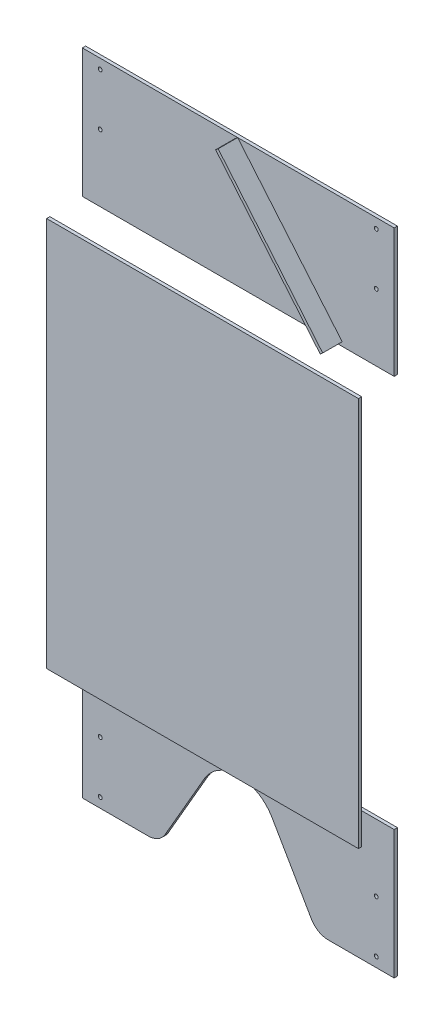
ISO-10303-21;
HEADER;
FILE_DESCRIPTION(('STEP AP214'),'2;1');
FILE_NAME('part.step','',(''),(''),'','','');
FILE_SCHEMA(('AUTOMOTIVE_DESIGN { 1 0 10303 214 1 1 1 1 }'));
ENDSEC;
DATA;
#1=APPLICATION_CONTEXT('core data for automotive mechanical design processes');
#2=APPLICATION_PROTOCOL_DEFINITION('international standard','automotive_design',2000,#1);
#3=PRODUCT_CONTEXT('',#1,'mechanical');
#4=PRODUCT('Part','Part','',(#3));
#5=PRODUCT_RELATED_PRODUCT_CATEGORY('part','',(#4));
#6=PRODUCT_DEFINITION_FORMATION('','',#4);
#7=PRODUCT_DEFINITION_CONTEXT('part definition',#1,'design');
#8=PRODUCT_DEFINITION('design','',#6,#7);
#9=PRODUCT_DEFINITION_SHAPE('','',#8);
#10=(LENGTH_UNIT() NAMED_UNIT(*) SI_UNIT(.MILLI.,.METRE.));
#11=(NAMED_UNIT(*) PLANE_ANGLE_UNIT() SI_UNIT($,.RADIAN.));
#12=(NAMED_UNIT(*) SI_UNIT($,.STERADIAN.) SOLID_ANGLE_UNIT());
#13=UNCERTAINTY_MEASURE_WITH_UNIT(LENGTH_MEASURE(1.E-05),#10,'distance_accuracy_value','');
#14=(GEOMETRIC_REPRESENTATION_CONTEXT(3) GLOBAL_UNCERTAINTY_ASSIGNED_CONTEXT((#13)) GLOBAL_UNIT_ASSIGNED_CONTEXT((#10,
#11,#12)) REPRESENTATION_CONTEXT('',''));
#15=CARTESIAN_POINT('',(0.,0.,0.));
#16=DIRECTION('',(0.,0.,1.));
#17=DIRECTION('',(1.,0.,0.));
#18=AXIS2_PLACEMENT_3D('',#15,#16,#17);
#19=CARTESIAN_POINT('',(212.5,-905.,-60.));
#20=DIRECTION('',(0.,0.,1.));
#21=DIRECTION('',(1.,0.,0.));
#22=AXIS2_PLACEMENT_3D('',#19,#20,#21);
#23=CYLINDRICAL_SURFACE('',#22,3.);
#24=CARTESIAN_POINT('',(212.5,-905.,-60.));
#25=DIRECTION('',(0.,0.,1.));
#26=DIRECTION('',(1.,0.,0.));
#27=AXIS2_PLACEMENT_3D('',#24,#25,#26);
#28=CIRCLE('',#27,3.);
#29=CARTESIAN_POINT('',(215.5,-905.,-60.));
#30=VERTEX_POINT('',#29);
#31=EDGE_CURVE('E184',#30,#30,#28,.T.);
#32=ORIENTED_EDGE('',*,*,#31,.F.);
#33=EDGE_LOOP('',(#32));
#34=FACE_BOUND('',#33,.T.);
#35=CARTESIAN_POINT('',(212.5,-905.,-55.));
#36=DIRECTION('',(0.,0.,1.));
#37=DIRECTION('',(1.,0.,0.));
#38=AXIS2_PLACEMENT_3D('',#35,#36,#37);
#39=CIRCLE('',#38,3.);
#40=CARTESIAN_POINT('',(215.5,-905.,-55.));
#41=VERTEX_POINT('',#40);
#42=EDGE_CURVE('E180',#41,#41,#39,.T.);
#43=ORIENTED_EDGE('',*,*,#42,.T.);
#44=EDGE_LOOP('',(#43));
#45=FACE_BOUND('',#44,.T.);
#46=ADVANCED_FACE('F45',(#34,#45),#23,.F.);
#47=CARTESIAN_POINT('',(212.5,-985.,-60.));
#48=DIRECTION('',(0.,0.,1.));
#49=DIRECTION('',(1.,0.,0.));
#50=AXIS2_PLACEMENT_3D('',#47,#48,#49);
#51=CYLINDRICAL_SURFACE('',#50,3.);
#52=CARTESIAN_POINT('',(212.5,-985.,-60.));
#53=DIRECTION('',(0.,0.,1.));
#54=DIRECTION('',(1.,0.,0.));
#55=AXIS2_PLACEMENT_3D('',#52,#53,#54);
#56=CIRCLE('',#55,3.);
#57=CARTESIAN_POINT('',(215.5,-985.,-60.));
#58=VERTEX_POINT('',#57);
#59=EDGE_CURVE('E187',#58,#58,#56,.T.);
#60=ORIENTED_EDGE('',*,*,#59,.F.);
#61=EDGE_LOOP('',(#60));
#62=FACE_BOUND('',#61,.T.);
#63=CARTESIAN_POINT('',(212.5,-985.,-55.));
#64=DIRECTION('',(0.,0.,1.));
#65=DIRECTION('',(1.,0.,0.));
#66=AXIS2_PLACEMENT_3D('',#63,#64,#65);
#67=CIRCLE('',#66,3.);
#68=CARTESIAN_POINT('',(215.5,-985.,-55.));
#69=VERTEX_POINT('',#68);
#70=EDGE_CURVE('E183',#69,#69,#67,.T.);
#71=ORIENTED_EDGE('',*,*,#70,.T.);
#72=EDGE_LOOP('',(#71));
#73=FACE_BOUND('',#72,.T.);
#74=ADVANCED_FACE('F242',(#62,#73),#51,.F.);
#75=CARTESIAN_POINT('',(-212.5,-905.,-60.));
#76=DIRECTION('',(0.,0.,1.));
#77=DIRECTION('',(1.,0.,0.));
#78=AXIS2_PLACEMENT_3D('',#75,#76,#77);
#79=CYLINDRICAL_SURFACE('',#78,3.);
#80=CARTESIAN_POINT('',(-212.5,-905.,-60.));
#81=DIRECTION('',(0.,0.,1.));
#82=DIRECTION('',(1.,0.,0.));
#83=AXIS2_PLACEMENT_3D('',#80,#81,#82);
#84=CIRCLE('',#83,3.);
#85=CARTESIAN_POINT('',(-209.5,-905.,-60.));
#86=VERTEX_POINT('',#85);
#87=EDGE_CURVE('E193',#86,#86,#84,.T.);
#88=ORIENTED_EDGE('',*,*,#87,.F.);
#89=EDGE_LOOP('',(#88));
#90=FACE_BOUND('',#89,.T.);
#91=CARTESIAN_POINT('',(-212.5,-905.,-55.));
#92=DIRECTION('',(0.,0.,1.));
#93=DIRECTION('',(1.,0.,0.));
#94=AXIS2_PLACEMENT_3D('',#91,#92,#93);
#95=CIRCLE('',#94,3.);
#96=CARTESIAN_POINT('',(-209.5,-905.,-55.));
#97=VERTEX_POINT('',#96);
#98=EDGE_CURVE('E190',#97,#97,#95,.T.);
#99=ORIENTED_EDGE('',*,*,#98,.T.);
#100=EDGE_LOOP('',(#99));
#101=FACE_BOUND('',#100,.T.);
#102=ADVANCED_FACE('F248',(#90,#101),#79,.F.);
#103=CARTESIAN_POINT('',(-212.5,-985.,-60.));
#104=DIRECTION('',(0.,0.,1.));
#105=DIRECTION('',(1.,0.,0.));
#106=AXIS2_PLACEMENT_3D('',#103,#104,#105);
#107=CYLINDRICAL_SURFACE('',#106,3.);
#108=CARTESIAN_POINT('',(-212.5,-985.,-60.));
#109=DIRECTION('',(0.,0.,1.));
#110=DIRECTION('',(1.,0.,0.));
#111=AXIS2_PLACEMENT_3D('',#108,#109,#110);
#112=CIRCLE('',#111,3.);
#113=CARTESIAN_POINT('',(-209.5,-985.,-60.));
#114=VERTEX_POINT('',#113);
#115=EDGE_CURVE('E198',#114,#114,#112,.T.);
#116=ORIENTED_EDGE('',*,*,#115,.F.);
#117=EDGE_LOOP('',(#116));
#118=FACE_BOUND('',#117,.T.);
#119=CARTESIAN_POINT('',(-212.5,-985.,-55.));
#120=DIRECTION('',(0.,0.,1.));
#121=DIRECTION('',(1.,0.,0.));
#122=AXIS2_PLACEMENT_3D('',#119,#120,#121);
#123=CIRCLE('',#122,3.);
#124=CARTESIAN_POINT('',(-209.5,-985.,-55.));
#125=VERTEX_POINT('',#124);
#126=EDGE_CURVE('E160',#125,#125,#123,.T.);
#127=ORIENTED_EDGE('',*,*,#126,.T.);
#128=EDGE_LOOP('',(#127));
#129=FACE_BOUND('',#128,.T.);
#130=ADVANCED_FACE('F259',(#118,#129),#107,.F.);
#131=CARTESIAN_POINT('',(138.564064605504,-1000.,-60.));
#132=DIRECTION('',(0.,-1.,0.));
#133=DIRECTION('',(0.,0.,-1.));
#134=AXIS2_PLACEMENT_3D('',#131,#132,#133);
#135=PLANE('',#134);
#136=DIRECTION('',(1.,0.,0.));
#137=VECTOR('',#136,1.);
#138=CARTESIAN_POINT('',(138.564064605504,-1000.,-55.));
#139=LINE('',#138,#137);
#140=CARTESIAN_POINT('',(138.564064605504,-1000.,-55.));
#141=VERTEX_POINT('',#140);
#142=CARTESIAN_POINT('',(240.,-1000.,-55.));
#143=VERTEX_POINT('',#142);
#144=EDGE_CURVE('E208',#141,#143,#139,.T.);
#145=ORIENTED_EDGE('',*,*,#144,.F.);
#146=DIRECTION('',(0.,0.,1.));
#147=VECTOR('',#146,1.);
#148=CARTESIAN_POINT('',(138.564064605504,-1000.,-60.));
#149=LINE('',#148,#147);
#150=CARTESIAN_POINT('',(138.564064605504,-1000.,-60.));
#151=VERTEX_POINT('',#150);
#152=EDGE_CURVE('E164',#151,#141,#149,.T.);
#153=ORIENTED_EDGE('',*,*,#152,.F.);
#154=DIRECTION('',(1.,0.,0.));
#155=VECTOR('',#154,1.);
#156=CARTESIAN_POINT('',(138.564064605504,-1000.,-60.));
#157=LINE('',#156,#155);
#158=CARTESIAN_POINT('',(240.,-1000.,-60.));
#159=VERTEX_POINT('',#158);
#160=EDGE_CURVE('E157',#151,#159,#157,.T.);
#161=ORIENTED_EDGE('',*,*,#160,.T.);
#162=DIRECTION('',(0.,0.,1.));
#163=VECTOR('',#162,1.);
#164=CARTESIAN_POINT('',(240.,-1000.,-60.));
#165=LINE('',#164,#163);
#166=EDGE_CURVE('E81',#159,#143,#165,.T.);
#167=ORIENTED_EDGE('',*,*,#166,.T.);
#168=EDGE_LOOP('',(#145,#153,#161,#167));
#169=FACE_BOUND('',#168,.T.);
#170=ADVANCED_FACE('F254',(#169),#135,.T.);
#171=CARTESIAN_POINT('',(138.564064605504,-970.,-60.));
#172=DIRECTION('',(0.,0.,1.));
#173=DIRECTION('',(1.,0.,0.));
#174=AXIS2_PLACEMENT_3D('',#171,#172,#173);
#175=CYLINDRICAL_SURFACE('',#174,30.);
#176=CARTESIAN_POINT('',(138.564064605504,-970.,-55.));
#177=DIRECTION('',(0.,0.,1.));
#178=DIRECTION('',(1.,0.,0.));
#179=AXIS2_PLACEMENT_3D('',#176,#177,#178);
#180=CIRCLE('',#179,30.);
#181=CARTESIAN_POINT('',(112.58330249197,-984.999999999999,-55.));
#182=VERTEX_POINT('',#181);
#183=EDGE_CURVE('E210',#182,#141,#180,.T.);
#184=ORIENTED_EDGE('',*,*,#183,.F.);
#185=DIRECTION('',(0.,0.,1.));
#186=VECTOR('',#185,1.);
#187=CARTESIAN_POINT('',(112.58330249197,-984.999999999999,-60.));
#188=LINE('',#187,#186);
#189=CARTESIAN_POINT('',(112.58330249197,-984.999999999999,-60.));
#190=VERTEX_POINT('',#189);
#191=EDGE_CURVE('E168',#190,#182,#188,.T.);
#192=ORIENTED_EDGE('',*,*,#191,.F.);
#193=CARTESIAN_POINT('',(138.564064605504,-970.,-60.));
#194=DIRECTION('',(0.,0.,1.));
#195=DIRECTION('',(1.,0.,0.));
#196=AXIS2_PLACEMENT_3D('',#193,#194,#195);
#197=CIRCLE('',#196,30.);
#198=EDGE_CURVE('E161',#190,#151,#197,.T.);
#199=ORIENTED_EDGE('',*,*,#198,.T.);
#200=ORIENTED_EDGE('',*,*,#152,.T.);
#201=EDGE_LOOP('',(#184,#192,#199,#200));
#202=FACE_BOUND('',#201,.T.);
#203=ADVANCED_FACE('F283',(#202),#175,.T.);
#204=CARTESIAN_POINT('',(112.58330249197,-984.999999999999,-60.));
#205=DIRECTION('',(-0.866025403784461,-0.499999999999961,0.));
#206=DIRECTION('',(0.499999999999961,-0.866025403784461,0.));
#207=AXIS2_PLACEMENT_3D('',#204,#205,#206);
#208=PLANE('',#207);
#209=DIRECTION('',(0.499999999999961,-0.866025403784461,0.));
#210=VECTOR('',#209,1.);
#211=CARTESIAN_POINT('',(112.58330249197,-984.999999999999,-55.));
#212=LINE('',#211,#210);
#213=CARTESIAN_POINT('',(51.9615242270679,-880.000000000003,-55.));
#214=VERTEX_POINT('',#213);
#215=EDGE_CURVE('E214',#214,#182,#212,.T.);
#216=ORIENTED_EDGE('',*,*,#215,.F.);
#217=DIRECTION('',(0.,0.,1.));
#218=VECTOR('',#217,1.);
#219=CARTESIAN_POINT('',(51.9615242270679,-880.000000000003,-60.));
#220=LINE('',#219,#218);
#221=CARTESIAN_POINT('',(51.9615242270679,-880.000000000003,-60.));
#222=VERTEX_POINT('',#221);
#223=EDGE_CURVE('E172',#222,#214,#220,.T.);
#224=ORIENTED_EDGE('',*,*,#223,.F.);
#225=DIRECTION('',(0.499999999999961,-0.866025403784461,0.));
#226=VECTOR('',#225,1.);
#227=CARTESIAN_POINT('',(112.58330249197,-984.999999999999,-60.));
#228=LINE('',#227,#226);
#229=EDGE_CURVE('E165',#222,#190,#228,.T.);
#230=ORIENTED_EDGE('',*,*,#229,.T.);
#231=ORIENTED_EDGE('',*,*,#191,.T.);
#232=EDGE_LOOP('',(#216,#224,#230,#231));
#233=FACE_BOUND('',#232,.T.);
#234=ADVANCED_FACE('F287',(#233),#208,.T.);
#235=CARTESIAN_POINT('',(0.,-910.,-60.));
#236=DIRECTION('',(0.,0.,1.));
#237=DIRECTION('',(1.,0.,0.));
#238=AXIS2_PLACEMENT_3D('',#235,#236,#237);
#239=CYLINDRICAL_SURFACE('',#238,60.);
#240=CARTESIAN_POINT('',(0.,-910.,-55.));
#241=DIRECTION('',(0.,0.,-1.));
#242=DIRECTION('',(1.,0.,0.));
#243=AXIS2_PLACEMENT_3D('',#240,#241,#242);
#244=CIRCLE('',#243,60.);
#245=CARTESIAN_POINT('',(-51.9615242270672,-880.000000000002,-55.));
#246=VERTEX_POINT('',#245);
#247=EDGE_CURVE('E221',#246,#214,#244,.T.);
#248=ORIENTED_EDGE('',*,*,#247,.F.);
#249=DIRECTION('',(0.,0.,1.));
#250=VECTOR('',#249,1.);
#251=CARTESIAN_POINT('',(-51.9615242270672,-880.000000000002,-60.));
#252=LINE('',#251,#250);
#253=CARTESIAN_POINT('',(-51.9615242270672,-880.000000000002,-60.));
#254=VERTEX_POINT('',#253);
#255=EDGE_CURVE('E124',#254,#246,#252,.T.);
#256=ORIENTED_EDGE('',*,*,#255,.F.);
#257=CARTESIAN_POINT('',(0.,-910.,-60.));
#258=DIRECTION('',(0.,0.,-1.));
#259=DIRECTION('',(1.,0.,0.));
#260=AXIS2_PLACEMENT_3D('',#257,#258,#259);
#261=CIRCLE('',#260,60.);
#262=EDGE_CURVE('E169',#254,#222,#261,.T.);
#263=ORIENTED_EDGE('',*,*,#262,.T.);
#264=ORIENTED_EDGE('',*,*,#223,.T.);
#265=EDGE_LOOP('',(#248,#256,#263,#264));
#266=FACE_BOUND('',#265,.T.);
#267=ADVANCED_FACE('F239',(#266),#239,.F.);
#268=CARTESIAN_POINT('',(-112.58330249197,-984.999999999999,-60.));
#269=DIRECTION('',(0.866025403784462,-0.49999999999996,0.));
#270=DIRECTION('',(0.49999999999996,0.866025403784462,0.));
#271=AXIS2_PLACEMENT_3D('',#268,#269,#270);
#272=PLANE('',#271);
#273=DIRECTION('',(0.49999999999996,0.866025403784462,0.));
#274=VECTOR('',#273,1.);
#275=CARTESIAN_POINT('',(-112.58330249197,-984.999999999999,-55.));
#276=LINE('',#275,#274);
#277=CARTESIAN_POINT('',(-112.58330249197,-984.999999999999,-55.));
#278=VERTEX_POINT('',#277);
#279=EDGE_CURVE('E153',#278,#246,#276,.T.);
#280=ORIENTED_EDGE('',*,*,#279,.F.);
#281=DIRECTION('',(0.,0.,1.));
#282=VECTOR('',#281,1.);
#283=CARTESIAN_POINT('',(-112.58330249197,-984.999999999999,-60.));
#284=LINE('',#283,#282);
#285=CARTESIAN_POINT('',(-112.58330249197,-984.999999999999,-60.));
#286=VERTEX_POINT('',#285);
#287=EDGE_CURVE('E177',#286,#278,#284,.T.);
#288=ORIENTED_EDGE('',*,*,#287,.F.);
#289=DIRECTION('',(0.49999999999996,0.866025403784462,0.));
#290=VECTOR('',#289,1.);
#291=CARTESIAN_POINT('',(-112.58330249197,-984.999999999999,-60.));
#292=LINE('',#291,#290);
#293=EDGE_CURVE('E173',#286,#254,#292,.T.);
#294=ORIENTED_EDGE('',*,*,#293,.T.);
#295=ORIENTED_EDGE('',*,*,#255,.T.);
#296=EDGE_LOOP('',(#280,#288,#294,#295));
#297=FACE_BOUND('',#296,.T.);
#298=ADVANCED_FACE('F224',(#297),#272,.T.);
#299=CARTESIAN_POINT('',(-138.564064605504,-970.,-60.));
#300=DIRECTION('',(0.,0.,1.));
#301=DIRECTION('',(1.,0.,0.));
#302=AXIS2_PLACEMENT_3D('',#299,#300,#301);
#303=CYLINDRICAL_SURFACE('',#302,29.9999999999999);
#304=CARTESIAN_POINT('',(-138.564064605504,-970.,-55.));
#305=DIRECTION('',(0.,0.,1.));
#306=DIRECTION('',(1.,0.,0.));
#307=AXIS2_PLACEMENT_3D('',#304,#305,#306);
#308=CIRCLE('',#307,29.9999999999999);
#309=CARTESIAN_POINT('',(-138.564064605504,-1000.,-55.));
#310=VERTEX_POINT('',#309);
#311=EDGE_CURVE('E151',#310,#278,#308,.T.);
#312=ORIENTED_EDGE('',*,*,#311,.F.);
#313=DIRECTION('',(0.,0.,1.));
#314=VECTOR('',#313,1.);
#315=CARTESIAN_POINT('',(-138.564064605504,-1000.,-60.));
#316=LINE('',#315,#314);
#317=CARTESIAN_POINT('',(-138.564064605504,-1000.,-60.));
#318=VERTEX_POINT('',#317);
#319=EDGE_CURVE('E114',#318,#310,#316,.T.);
#320=ORIENTED_EDGE('',*,*,#319,.F.);
#321=CARTESIAN_POINT('',(-138.564064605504,-970.,-60.));
#322=DIRECTION('',(0.,0.,1.));
#323=DIRECTION('',(1.,0.,0.));
#324=AXIS2_PLACEMENT_3D('',#321,#322,#323);
#325=CIRCLE('',#324,29.9999999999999);
#326=EDGE_CURVE('E175',#318,#286,#325,.T.);
#327=ORIENTED_EDGE('',*,*,#326,.T.);
#328=ORIENTED_EDGE('',*,*,#287,.T.);
#329=EDGE_LOOP('',(#312,#320,#327,#328));
#330=FACE_BOUND('',#329,.T.);
#331=ADVANCED_FACE('F231',(#330),#303,.T.);
#332=CARTESIAN_POINT('',(-240.,-1000.,-60.));
#333=DIRECTION('',(0.,-1.,0.));
#334=DIRECTION('',(0.,0.,-1.));
#335=AXIS2_PLACEMENT_3D('',#332,#333,#334);
#336=PLANE('',#335);
#337=DIRECTION('',(1.,0.,0.));
#338=VECTOR('',#337,1.);
#339=CARTESIAN_POINT('',(-240.,-1000.,-55.));
#340=LINE('',#339,#338);
#341=CARTESIAN_POINT('',(-240.,-1000.,-55.));
#342=VERTEX_POINT('',#341);
#343=EDGE_CURVE('E139',#342,#310,#340,.T.);
#344=ORIENTED_EDGE('',*,*,#343,.F.);
#345=DIRECTION('',(0.,0.,1.));
#346=VECTOR('',#345,1.);
#347=CARTESIAN_POINT('',(-240.,-1000.,-60.));
#348=LINE('',#347,#346);
#349=CARTESIAN_POINT('',(-240.,-1000.,-60.));
#350=VERTEX_POINT('',#349);
#351=EDGE_CURVE('E143',#350,#342,#348,.T.);
#352=ORIENTED_EDGE('',*,*,#351,.F.);
#353=DIRECTION('',(1.,0.,0.));
#354=VECTOR('',#353,1.);
#355=CARTESIAN_POINT('',(-240.,-1000.,-60.));
#356=LINE('',#355,#354);
#357=EDGE_CURVE('E178',#350,#318,#356,.T.);
#358=ORIENTED_EDGE('',*,*,#357,.T.);
#359=ORIENTED_EDGE('',*,*,#319,.T.);
#360=EDGE_LOOP('',(#344,#352,#358,#359));
#361=FACE_BOUND('',#360,.T.);
#362=ADVANCED_FACE('F150',(#361),#336,.T.);
#363=CARTESIAN_POINT('',(138.564064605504,-970.,-55.));
#364=DIRECTION('',(0.,0.,1.));
#365=DIRECTION('',(1.,0.,0.));
#366=AXIS2_PLACEMENT_3D('',#363,#364,#365);
#367=PLANE('',#366);
#368=DIRECTION('',(1.,0.,0.));
#369=VECTOR('',#368,1.);
#370=CARTESIAN_POINT('',(138.564064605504,-802.,-55.));
#371=LINE('',#370,#369);
#372=CARTESIAN_POINT('',(-240.,-802.,-55.));
#373=VERTEX_POINT('',#372);
#374=CARTESIAN_POINT('',(240.,-802.,-55.));
#375=VERTEX_POINT('',#374);
#376=EDGE_CURVE('E12',#373,#375,#371,.T.);
#377=ORIENTED_EDGE('',*,*,#376,.F.);
#378=DIRECTION('',(0.,-1.,0.));
#379=VECTOR('',#378,1.);
#380=CARTESIAN_POINT('',(-240.,0.,-55.));
#381=LINE('',#380,#379);
#382=EDGE_CURVE('E49',#373,#342,#381,.T.);
#383=ORIENTED_EDGE('',*,*,#382,.T.);
#384=ORIENTED_EDGE('',*,*,#343,.T.);
#385=ORIENTED_EDGE('',*,*,#311,.T.);
#386=ORIENTED_EDGE('',*,*,#279,.T.);
#387=ORIENTED_EDGE('',*,*,#247,.T.);
#388=ORIENTED_EDGE('',*,*,#215,.T.);
#389=ORIENTED_EDGE('',*,*,#183,.T.);
#390=ORIENTED_EDGE('',*,*,#144,.T.);
#391=DIRECTION('',(0.,1.,0.));
#392=VECTOR('',#391,1.);
#393=CARTESIAN_POINT('',(240.,0.,-55.));
#394=LINE('',#393,#392);
#395=EDGE_CURVE('E203',#143,#375,#394,.T.);
#396=ORIENTED_EDGE('',*,*,#395,.T.);
#397=EDGE_LOOP('',(#377,#383,#384,#385,#386,#387,#388,#389,#390,#396));
#398=FACE_BOUND('',#397,.T.);
#399=ORIENTED_EDGE('',*,*,#126,.F.);
#400=EDGE_LOOP('',(#399));
#401=FACE_BOUND('',#400,.T.);
#402=ORIENTED_EDGE('',*,*,#98,.F.);
#403=EDGE_LOOP('',(#402));
#404=FACE_BOUND('',#403,.T.);
#405=ORIENTED_EDGE('',*,*,#70,.F.);
#406=EDGE_LOOP('',(#405));
#407=FACE_BOUND('',#406,.T.);
#408=ORIENTED_EDGE('',*,*,#42,.F.);
#409=EDGE_LOOP('',(#408));
#410=FACE_BOUND('',#409,.T.);
#411=ADVANCED_FACE('F136',(#398,#401,#404,#407,#410),#367,.T.);
#412=CARTESIAN_POINT('',(138.564064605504,-970.,-60.));
#413=DIRECTION('',(0.,0.,1.));
#414=DIRECTION('',(1.,0.,0.));
#415=AXIS2_PLACEMENT_3D('',#412,#413,#414);
#416=PLANE('',#415);
#417=ORIENTED_EDGE('',*,*,#115,.T.);
#418=EDGE_LOOP('',(#417));
#419=FACE_BOUND('',#418,.T.);
#420=ORIENTED_EDGE('',*,*,#87,.T.);
#421=EDGE_LOOP('',(#420));
#422=FACE_BOUND('',#421,.T.);
#423=ORIENTED_EDGE('',*,*,#59,.T.);
#424=EDGE_LOOP('',(#423));
#425=FACE_BOUND('',#424,.T.);
#426=ORIENTED_EDGE('',*,*,#31,.T.);
#427=EDGE_LOOP('',(#426));
#428=FACE_BOUND('',#427,.T.);
#429=DIRECTION('',(0.,-1.,0.));
#430=VECTOR('',#429,1.);
#431=CARTESIAN_POINT('',(-240.,0.,-60.));
#432=LINE('',#431,#430);
#433=CARTESIAN_POINT('',(-240.,-802.,-60.));
#434=VERTEX_POINT('',#433);
#435=EDGE_CURVE('E146',#434,#350,#432,.T.);
#436=ORIENTED_EDGE('',*,*,#435,.F.);
#437=DIRECTION('',(-1.,0.,0.));
#438=VECTOR('',#437,1.);
#439=CARTESIAN_POINT('',(-348.,-802.,-60.));
#440=LINE('',#439,#438);
#441=CARTESIAN_POINT('',(240.,-802.,-60.));
#442=VERTEX_POINT('',#441);
#443=EDGE_CURVE('E71',#442,#434,#440,.T.);
#444=ORIENTED_EDGE('',*,*,#443,.F.);
#445=DIRECTION('',(0.,1.,0.));
#446=VECTOR('',#445,1.);
#447=CARTESIAN_POINT('',(240.,0.,-60.));
#448=LINE('',#447,#446);
#449=EDGE_CURVE('E148',#159,#442,#448,.T.);
#450=ORIENTED_EDGE('',*,*,#449,.F.);
#451=ORIENTED_EDGE('',*,*,#160,.F.);
#452=ORIENTED_EDGE('',*,*,#198,.F.);
#453=ORIENTED_EDGE('',*,*,#229,.F.);
#454=ORIENTED_EDGE('',*,*,#262,.F.);
#455=ORIENTED_EDGE('',*,*,#293,.F.);
#456=ORIENTED_EDGE('',*,*,#326,.F.);
#457=ORIENTED_EDGE('',*,*,#357,.F.);
#458=EDGE_LOOP('',(#436,#444,#450,#451,#452,#453,#454,#455,#456,#457));
#459=FACE_BOUND('',#458,.T.);
#460=ADVANCED_FACE('F229',(#419,#422,#425,#428,#459),#416,.F.);
#461=CARTESIAN_POINT('',(-240.,0.,-60.));
#462=DIRECTION('',(-1.,0.,0.));
#463=DIRECTION('',(0.,-1.,0.));
#464=AXIS2_PLACEMENT_3D('',#461,#462,#463);
#465=PLANE('',#464);
#466=DIRECTION('',(0.,0.,1.));
#467=VECTOR('',#466,1.);
#468=CARTESIAN_POINT('',(-240.,-802.,-60.));
#469=LINE('',#468,#467);
#470=EDGE_CURVE('E55',#434,#373,#469,.T.);
#471=ORIENTED_EDGE('',*,*,#470,.F.);
#472=ORIENTED_EDGE('',*,*,#435,.T.);
#473=ORIENTED_EDGE('',*,*,#351,.T.);
#474=ORIENTED_EDGE('',*,*,#382,.F.);
#475=EDGE_LOOP('',(#471,#472,#473,#474));
#476=FACE_BOUND('',#475,.T.);
#477=ADVANCED_FACE('F144',(#476),#465,.T.);
#478=CARTESIAN_POINT('',(240.,0.,-60.));
#479=DIRECTION('',(1.,0.,0.));
#480=DIRECTION('',(0.,1.,0.));
#481=AXIS2_PLACEMENT_3D('',#478,#479,#480);
#482=PLANE('',#481);
#483=DIRECTION('',(0.,0.,-1.));
#484=VECTOR('',#483,1.);
#485=CARTESIAN_POINT('',(240.,-802.,-60.));
#486=LINE('',#485,#484);
#487=EDGE_CURVE('E74',#375,#442,#486,.T.);
#488=ORIENTED_EDGE('',*,*,#487,.F.);
#489=ORIENTED_EDGE('',*,*,#395,.F.);
#490=ORIENTED_EDGE('',*,*,#166,.F.);
#491=ORIENTED_EDGE('',*,*,#449,.T.);
#492=EDGE_LOOP('',(#488,#489,#490,#491));
#493=FACE_BOUND('',#492,.T.);
#494=ADVANCED_FACE('F47',(#493),#482,.T.);
#495=CARTESIAN_POINT('',(-348.,-802.,-55.));
#496=DIRECTION('',(0.,-1.,0.));
#497=DIRECTION('',(0.,0.,-1.));
#498=AXIS2_PLACEMENT_3D('',#495,#496,#497);
#499=PLANE('',#498);
#500=ORIENTED_EDGE('',*,*,#487,.T.);
#501=ORIENTED_EDGE('',*,*,#443,.T.);
#502=ORIENTED_EDGE('',*,*,#470,.T.);
#503=ORIENTED_EDGE('',*,*,#376,.T.);
#504=EDGE_LOOP('',(#500,#501,#502,#503));
#505=FACE_BOUND('',#504,.T.);
#506=ADVANCED_FACE('F264',(#505),#499,.F.);
#507=CLOSED_SHELL('',(#46,#74,#102,#130,#170,#203,#234,#267,#298,#331,#362,#411,#460,#477,#494,#506));
#508=MANIFOLD_SOLID_BREP('B2',#507);
#509=CARTESIAN_POINT('',(240.,0.,-60.));
#510=DIRECTION('',(1.,0.,0.));
#511=DIRECTION('',(0.,1.,0.));
#512=AXIS2_PLACEMENT_3D('',#509,#510,#511);
#513=PLANE('',#512);
#514=DIRECTION('',(0.,0.,1.));
#515=VECTOR('',#514,1.);
#516=CARTESIAN_POINT('',(240.,-198.,-60.));
#517=LINE('',#516,#515);
#518=CARTESIAN_POINT('',(240.,-198.,-60.));
#519=VERTEX_POINT('',#518);
#520=CARTESIAN_POINT('',(240.,-198.,-55.));
#521=VERTEX_POINT('',#520);
#522=EDGE_CURVE('E514',#519,#521,#517,.T.);
#523=ORIENTED_EDGE('',*,*,#522,.F.);
#524=DIRECTION('',(0.,1.,0.));
#525=VECTOR('',#524,1.);
#526=CARTESIAN_POINT('',(240.,0.,-60.));
#527=LINE('',#526,#525);
#528=CARTESIAN_POINT('',(240.,0.,-60.));
#529=VERTEX_POINT('',#528);
#530=EDGE_CURVE('E504',#519,#529,#527,.T.);
#531=ORIENTED_EDGE('',*,*,#530,.T.);
#532=DIRECTION('',(0.,0.,1.));
#533=VECTOR('',#532,1.);
#534=CARTESIAN_POINT('',(240.,0.,-60.));
#535=LINE('',#534,#533);
#536=CARTESIAN_POINT('',(240.,0.,-55.));
#537=VERTEX_POINT('',#536);
#538=EDGE_CURVE('E506',#529,#537,#535,.T.);
#539=ORIENTED_EDGE('',*,*,#538,.T.);
#540=DIRECTION('',(0.,1.,0.));
#541=VECTOR('',#540,1.);
#542=CARTESIAN_POINT('',(240.,0.,-55.));
#543=LINE('',#542,#541);
#544=EDGE_CURVE('E534',#521,#537,#543,.T.);
#545=ORIENTED_EDGE('',*,*,#544,.F.);
#546=EDGE_LOOP('',(#523,#531,#539,#545));
#547=FACE_BOUND('',#546,.T.);
#548=ADVANCED_FACE('F417',(#547),#513,.T.);
#549=CARTESIAN_POINT('',(-240.,0.,-60.));
#550=DIRECTION('',(-1.,0.,0.));
#551=DIRECTION('',(0.,-1.,0.));
#552=AXIS2_PLACEMENT_3D('',#549,#550,#551);
#553=PLANE('',#552);
#554=DIRECTION('',(0.,0.,-1.));
#555=VECTOR('',#554,1.);
#556=CARTESIAN_POINT('',(-240.,-198.,-60.));
#557=LINE('',#556,#555);
#558=CARTESIAN_POINT('',(-240.,-198.,-55.));
#559=VERTEX_POINT('',#558);
#560=CARTESIAN_POINT('',(-240.,-198.,-60.));
#561=VERTEX_POINT('',#560);
#562=EDGE_CURVE('E425',#559,#561,#557,.T.);
#563=ORIENTED_EDGE('',*,*,#562,.F.);
#564=DIRECTION('',(0.,-1.,0.));
#565=VECTOR('',#564,1.);
#566=CARTESIAN_POINT('',(-240.,0.,-55.));
#567=LINE('',#566,#565);
#568=CARTESIAN_POINT('',(-240.,0.,-55.));
#569=VERTEX_POINT('',#568);
#570=EDGE_CURVE('E420',#569,#559,#567,.T.);
#571=ORIENTED_EDGE('',*,*,#570,.F.);
#572=DIRECTION('',(0.,0.,1.));
#573=VECTOR('',#572,1.);
#574=CARTESIAN_POINT('',(-240.,0.,-60.));
#575=LINE('',#574,#573);
#576=CARTESIAN_POINT('',(-240.,0.,-60.));
#577=VERTEX_POINT('',#576);
#578=EDGE_CURVE('E518',#577,#569,#575,.T.);
#579=ORIENTED_EDGE('',*,*,#578,.F.);
#580=DIRECTION('',(0.,-1.,0.));
#581=VECTOR('',#580,1.);
#582=CARTESIAN_POINT('',(-240.,0.,-60.));
#583=LINE('',#582,#581);
#584=EDGE_CURVE('E517',#577,#561,#583,.T.);
#585=ORIENTED_EDGE('',*,*,#584,.T.);
#586=EDGE_LOOP('',(#563,#571,#579,#585));
#587=FACE_BOUND('',#586,.T.);
#588=ADVANCED_FACE('F570',(#587),#553,.T.);
#589=CARTESIAN_POINT('',(138.564064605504,-970.,-60.));
#590=DIRECTION('',(0.,0.,1.));
#591=DIRECTION('',(1.,0.,0.));
#592=AXIS2_PLACEMENT_3D('',#589,#590,#591);
#593=PLANE('',#592);
#594=CARTESIAN_POINT('',(-212.5,-15.0000000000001,-60.));
#595=DIRECTION('',(0.,0.,1.));
#596=DIRECTION('',(1.,0.,0.));
#597=AXIS2_PLACEMENT_3D('',#594,#595,#596);
#598=CIRCLE('',#597,3.);
#599=CARTESIAN_POINT('',(-209.5,-15.0000000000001,-60.));
#600=VERTEX_POINT('',#599);
#601=EDGE_CURVE('E547',#600,#600,#598,.T.);
#602=ORIENTED_EDGE('',*,*,#601,.T.);
#603=EDGE_LOOP('',(#602));
#604=FACE_BOUND('',#603,.T.);
#605=CARTESIAN_POINT('',(-212.5,-95.,-60.));
#606=DIRECTION('',(0.,0.,1.));
#607=DIRECTION('',(1.,0.,0.));
#608=AXIS2_PLACEMENT_3D('',#605,#606,#607);
#609=CIRCLE('',#608,3.);
#610=CARTESIAN_POINT('',(-209.5,-95.,-60.));
#611=VERTEX_POINT('',#610);
#612=EDGE_CURVE('E541',#611,#611,#609,.T.);
#613=ORIENTED_EDGE('',*,*,#612,.T.);
#614=EDGE_LOOP('',(#613));
#615=FACE_BOUND('',#614,.T.);
#616=CARTESIAN_POINT('',(212.5,-15.0000000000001,-60.));
#617=DIRECTION('',(0.,0.,1.));
#618=DIRECTION('',(1.,0.,0.));
#619=AXIS2_PLACEMENT_3D('',#616,#617,#618);
#620=CIRCLE('',#619,3.);
#621=CARTESIAN_POINT('',(215.5,-15.0000000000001,-60.));
#622=VERTEX_POINT('',#621);
#623=EDGE_CURVE('E535',#622,#622,#620,.T.);
#624=ORIENTED_EDGE('',*,*,#623,.T.);
#625=EDGE_LOOP('',(#624));
#626=FACE_BOUND('',#625,.T.);
#627=CARTESIAN_POINT('',(212.5,-95.,-60.));
#628=DIRECTION('',(0.,0.,1.));
#629=DIRECTION('',(1.,0.,0.));
#630=AXIS2_PLACEMENT_3D('',#627,#628,#629);
#631=CIRCLE('',#630,3.);
#632=CARTESIAN_POINT('',(215.5,-95.,-60.));
#633=VERTEX_POINT('',#632);
#634=EDGE_CURVE('E531',#633,#633,#631,.T.);
#635=ORIENTED_EDGE('',*,*,#634,.T.);
#636=EDGE_LOOP('',(#635));
#637=FACE_BOUND('',#636,.T.);
#638=ORIENTED_EDGE('',*,*,#530,.F.);
#639=DIRECTION('',(1.,0.,0.));
#640=VECTOR('',#639,1.);
#641=CARTESIAN_POINT('',(302.,-198.,-60.));
#642=LINE('',#641,#640);
#643=EDGE_CURVE('E43',#561,#519,#642,.T.);
#644=ORIENTED_EDGE('',*,*,#643,.F.);
#645=ORIENTED_EDGE('',*,*,#584,.F.);
#646=DIRECTION('',(-1.,0.,0.));
#647=VECTOR('',#646,1.);
#648=CARTESIAN_POINT('',(240.,0.,-60.));
#649=LINE('',#648,#647);
#650=EDGE_CURVE('E522',#529,#577,#649,.T.);
#651=ORIENTED_EDGE('',*,*,#650,.F.);
#652=EDGE_LOOP('',(#638,#644,#645,#651));
#653=FACE_BOUND('',#652,.T.);
#654=ADVANCED_FACE('F577',(#604,#615,#626,#637,#653),#593,.F.);
#655=CARTESIAN_POINT('',(138.564064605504,-970.,-55.));
#656=DIRECTION('',(0.,0.,1.));
#657=DIRECTION('',(1.,0.,0.));
#658=AXIS2_PLACEMENT_3D('',#655,#656,#657);
#659=PLANE('',#658);
#660=DIRECTION('',(-0.766044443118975,-0.642787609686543,0.));
#661=VECTOR('',#660,1.);
#662=CARTESIAN_POINT('',(-4.75783606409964,-3.21393804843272,-55.));
#663=LINE('',#662,#661);
#664=CARTESIAN_POINT('',(-0.927613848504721,0.,-55.));
#665=VERTEX_POINT('',#664);
#666=CARTESIAN_POINT('',(-4.75783606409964,-3.21393804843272,-55.));
#667=VERTEX_POINT('',#666);
#668=EDGE_CURVE('E503',#665,#667,#663,.T.);
#669=ORIENTED_EDGE('',*,*,#668,.F.);
#670=DIRECTION('',(-1.,0.,0.));
#671=VECTOR('',#670,1.);
#672=CARTESIAN_POINT('',(240.,0.,-55.));
#673=LINE('',#672,#671);
#674=EDGE_CURVE('E525',#665,#569,#673,.T.);
#675=ORIENTED_EDGE('',*,*,#674,.T.);
#676=ORIENTED_EDGE('',*,*,#570,.T.);
#677=DIRECTION('',(-1.,0.,0.));
#678=VECTOR('',#677,1.);
#679=CARTESIAN_POINT('',(138.564064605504,-198.,-55.));
#680=LINE('',#679,#678);
#681=EDGE_CURVE('E512',#521,#559,#680,.T.);
#682=ORIENTED_EDGE('',*,*,#681,.F.);
#683=ORIENTED_EDGE('',*,*,#544,.T.);
#684=EDGE_CURVE('E523',#537,#665,#673,.T.);
#685=ORIENTED_EDGE('',*,*,#684,.T.);
#686=DIRECTION('',(-0.642787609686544,0.766044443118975,0.));
#687=VECTOR('',#686,1.);
#688=CARTESIAN_POINT('',(-0.92761384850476,0.,-55.));
#689=LINE('',#688,#687);
#690=CARTESIAN_POINT('',(160.,-191.786061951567,-55.));
#691=VERTEX_POINT('',#690);
#692=EDGE_CURVE('E433',#691,#665,#689,.T.);
#693=ORIENTED_EDGE('',*,*,#692,.F.);
#694=DIRECTION('',(0.76604444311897,0.642787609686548,0.));
#695=VECTOR('',#694,1.);
#696=CARTESIAN_POINT('',(160.,-191.786061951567,-55.));
#697=LINE('',#696,#695);
#698=CARTESIAN_POINT('',(156.169777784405,-195.,-55.));
#699=VERTEX_POINT('',#698);
#700=EDGE_CURVE('E584',#699,#691,#697,.T.);
#701=ORIENTED_EDGE('',*,*,#700,.F.);
#702=DIRECTION('',(0.642787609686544,-0.766044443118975,0.));
#703=VECTOR('',#702,1.);
#704=CARTESIAN_POINT('',(156.169777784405,-195.,-55.));
#705=LINE('',#704,#703);
#706=EDGE_CURVE('E439',#667,#699,#705,.T.);
#707=ORIENTED_EDGE('',*,*,#706,.F.);
#708=EDGE_LOOP('',(#669,#675,#676,#682,#683,#685,#693,#701,#707));
#709=FACE_BOUND('',#708,.T.);
#710=CARTESIAN_POINT('',(-212.5,-15.0000000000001,-55.));
#711=DIRECTION('',(0.,0.,1.));
#712=DIRECTION('',(1.,0.,0.));
#713=AXIS2_PLACEMENT_3D('',#710,#711,#712);
#714=CIRCLE('',#713,3.);
#715=CARTESIAN_POINT('',(-209.5,-15.0000000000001,-55.));
#716=VERTEX_POINT('',#715);
#717=EDGE_CURVE('E544',#716,#716,#714,.T.);
#718=ORIENTED_EDGE('',*,*,#717,.F.);
#719=EDGE_LOOP('',(#718));
#720=FACE_BOUND('',#719,.T.);
#721=CARTESIAN_POINT('',(-212.5,-95.,-55.));
#722=DIRECTION('',(0.,0.,1.));
#723=DIRECTION('',(1.,0.,0.));
#724=AXIS2_PLACEMENT_3D('',#721,#722,#723);
#725=CIRCLE('',#724,3.);
#726=CARTESIAN_POINT('',(-209.5,-95.,-55.));
#727=VERTEX_POINT('',#726);
#728=EDGE_CURVE('E538',#727,#727,#725,.T.);
#729=ORIENTED_EDGE('',*,*,#728,.F.);
#730=EDGE_LOOP('',(#729));
#731=FACE_BOUND('',#730,.T.);
#732=CARTESIAN_POINT('',(212.5,-15.0000000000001,-55.));
#733=DIRECTION('',(0.,0.,1.));
#734=DIRECTION('',(1.,0.,0.));
#735=AXIS2_PLACEMENT_3D('',#732,#733,#734);
#736=CIRCLE('',#735,3.);
#737=CARTESIAN_POINT('',(215.5,-15.0000000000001,-55.));
#738=VERTEX_POINT('',#737);
#739=EDGE_CURVE('E530',#738,#738,#736,.T.);
#740=ORIENTED_EDGE('',*,*,#739,.F.);
#741=EDGE_LOOP('',(#740));
#742=FACE_BOUND('',#741,.T.);
#743=CARTESIAN_POINT('',(212.5,-95.,-55.));
#744=DIRECTION('',(0.,0.,1.));
#745=DIRECTION('',(1.,0.,0.));
#746=AXIS2_PLACEMENT_3D('',#743,#744,#745);
#747=CIRCLE('',#746,3.);
#748=CARTESIAN_POINT('',(215.5,-95.,-55.));
#749=VERTEX_POINT('',#748);
#750=EDGE_CURVE('E521',#749,#749,#747,.T.);
#751=ORIENTED_EDGE('',*,*,#750,.F.);
#752=EDGE_LOOP('',(#751));
#753=FACE_BOUND('',#752,.T.);
#754=ADVANCED_FACE('F559',(#709,#720,#731,#742,#753),#659,.T.);
#755=CARTESIAN_POINT('',(240.,0.,-60.));
#756=DIRECTION('',(0.,1.,0.));
#757=DIRECTION('',(0.,0.,1.));
#758=AXIS2_PLACEMENT_3D('',#755,#756,#757);
#759=PLANE('',#758);
#760=ORIENTED_EDGE('',*,*,#684,.F.);
#761=ORIENTED_EDGE('',*,*,#538,.F.);
#762=ORIENTED_EDGE('',*,*,#650,.T.);
#763=ORIENTED_EDGE('',*,*,#578,.T.);
#764=ORIENTED_EDGE('',*,*,#674,.F.);
#765=EDGE_LOOP('',(#760,#761,#762,#763,#764));
#766=FACE_BOUND('',#765,.T.);
#767=ADVANCED_FACE('F564',(#766),#759,.T.);
#768=CARTESIAN_POINT('',(212.5,-95.,-60.));
#769=DIRECTION('',(0.,0.,1.));
#770=DIRECTION('',(1.,0.,0.));
#771=AXIS2_PLACEMENT_3D('',#768,#769,#770);
#772=CYLINDRICAL_SURFACE('',#771,3.);
#773=ORIENTED_EDGE('',*,*,#634,.F.);
#774=EDGE_LOOP('',(#773));
#775=FACE_BOUND('',#774,.T.);
#776=ORIENTED_EDGE('',*,*,#750,.T.);
#777=EDGE_LOOP('',(#776));
#778=FACE_BOUND('',#777,.T.);
#779=ADVANCED_FACE('F627',(#775,#778),#772,.F.);
#780=CARTESIAN_POINT('',(212.5,-15.0000000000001,-60.));
#781=DIRECTION('',(0.,0.,1.));
#782=DIRECTION('',(1.,0.,0.));
#783=AXIS2_PLACEMENT_3D('',#780,#781,#782);
#784=CYLINDRICAL_SURFACE('',#783,3.);
#785=ORIENTED_EDGE('',*,*,#623,.F.);
#786=EDGE_LOOP('',(#785));
#787=FACE_BOUND('',#786,.T.);
#788=ORIENTED_EDGE('',*,*,#739,.T.);
#789=EDGE_LOOP('',(#788));
#790=FACE_BOUND('',#789,.T.);
#791=ADVANCED_FACE('F623',(#787,#790),#784,.F.);
#792=CARTESIAN_POINT('',(-212.5,-95.,-60.));
#793=DIRECTION('',(0.,0.,1.));
#794=DIRECTION('',(1.,0.,0.));
#795=AXIS2_PLACEMENT_3D('',#792,#793,#794);
#796=CYLINDRICAL_SURFACE('',#795,3.);
#797=ORIENTED_EDGE('',*,*,#612,.F.);
#798=EDGE_LOOP('',(#797));
#799=FACE_BOUND('',#798,.T.);
#800=ORIENTED_EDGE('',*,*,#728,.T.);
#801=EDGE_LOOP('',(#800));
#802=FACE_BOUND('',#801,.T.);
#803=ADVANCED_FACE('F619',(#799,#802),#796,.F.);
#804=CARTESIAN_POINT('',(-212.5,-15.0000000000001,-60.));
#805=DIRECTION('',(0.,0.,1.));
#806=DIRECTION('',(1.,0.,0.));
#807=AXIS2_PLACEMENT_3D('',#804,#805,#806);
#808=CYLINDRICAL_SURFACE('',#807,3.);
#809=ORIENTED_EDGE('',*,*,#601,.F.);
#810=EDGE_LOOP('',(#809));
#811=FACE_BOUND('',#810,.T.);
#812=ORIENTED_EDGE('',*,*,#717,.T.);
#813=EDGE_LOOP('',(#812));
#814=FACE_BOUND('',#813,.T.);
#815=ADVANCED_FACE('F616',(#811,#814),#808,.F.);
#816=CARTESIAN_POINT('',(302.,-198.,-55.));
#817=DIRECTION('',(0.,1.,0.));
#818=DIRECTION('',(0.,0.,1.));
#819=AXIS2_PLACEMENT_3D('',#816,#817,#818);
#820=PLANE('',#819);
#821=ORIENTED_EDGE('',*,*,#522,.T.);
#822=ORIENTED_EDGE('',*,*,#681,.T.);
#823=ORIENTED_EDGE('',*,*,#562,.T.);
#824=ORIENTED_EDGE('',*,*,#643,.T.);
#825=EDGE_LOOP('',(#821,#822,#823,#824));
#826=FACE_BOUND('',#825,.T.);
#827=ADVANCED_FACE('F573',(#826),#820,.F.);
#828=CARTESIAN_POINT('',(-4.75783606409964,-3.21393804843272,-25.));
#829=DIRECTION('',(0.642787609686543,-0.766044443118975,0.));
#830=DIRECTION('',(0.766044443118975,0.642787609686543,0.));
#831=AXIS2_PLACEMENT_3D('',#828,#829,#830);
#832=PLANE('',#831);
#833=ORIENTED_EDGE('',*,*,#668,.T.);
#834=DIRECTION('',(0.,0.,-1.));
#835=VECTOR('',#834,1.);
#836=CARTESIAN_POINT('',(-4.75783606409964,-3.21393804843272,-25.));
#837=LINE('',#836,#835);
#838=CARTESIAN_POINT('',(-4.75783606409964,-3.21393804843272,-25.));
#839=VERTEX_POINT('',#838);
#840=EDGE_CURVE('E485',#839,#667,#837,.T.);
#841=ORIENTED_EDGE('',*,*,#840,.F.);
#842=DIRECTION('',(-0.766044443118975,-0.642787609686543,0.));
#843=VECTOR('',#842,1.);
#844=CARTESIAN_POINT('',(-4.75783606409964,-3.21393804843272,-25.));
#845=LINE('',#844,#843);
#846=CARTESIAN_POINT('',(-0.92761384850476,0.,-25.));
#847=VERTEX_POINT('',#846);
#848=EDGE_CURVE('E492',#847,#839,#845,.T.);
#849=ORIENTED_EDGE('',*,*,#848,.F.);
#850=DIRECTION('',(0.,0.,-1.));
#851=VECTOR('',#850,1.);
#852=CARTESIAN_POINT('',(-0.92761384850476,0.,-25.));
#853=LINE('',#852,#851);
#854=EDGE_CURVE('E582',#847,#665,#853,.T.);
#855=ORIENTED_EDGE('',*,*,#854,.T.);
#856=EDGE_LOOP('',(#833,#841,#849,#855));
#857=FACE_BOUND('',#856,.T.);
#858=ADVANCED_FACE('F502',(#857),#832,.F.);
#859=CARTESIAN_POINT('',(156.169777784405,-195.,-25.));
#860=DIRECTION('',(0.766044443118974,0.642787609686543,0.));
#861=DIRECTION('',(-0.642787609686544,0.766044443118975,0.));
#862=AXIS2_PLACEMENT_3D('',#859,#860,#861);
#863=PLANE('',#862);
#864=ORIENTED_EDGE('',*,*,#706,.T.);
#865=DIRECTION('',(0.,0.,-1.));
#866=VECTOR('',#865,1.);
#867=CARTESIAN_POINT('',(156.169777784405,-195.,-25.));
#868=LINE('',#867,#866);
#869=CARTESIAN_POINT('',(156.169777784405,-195.,-25.));
#870=VERTEX_POINT('',#869);
#871=EDGE_CURVE('E488',#870,#699,#868,.T.);
#872=ORIENTED_EDGE('',*,*,#871,.F.);
#873=DIRECTION('',(0.642787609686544,-0.766044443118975,0.));
#874=VECTOR('',#873,1.);
#875=CARTESIAN_POINT('',(156.169777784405,-195.,-25.));
#876=LINE('',#875,#874);
#877=EDGE_CURVE('E481',#839,#870,#876,.T.);
#878=ORIENTED_EDGE('',*,*,#877,.F.);
#879=ORIENTED_EDGE('',*,*,#840,.T.);
#880=EDGE_LOOP('',(#864,#872,#878,#879));
#881=FACE_BOUND('',#880,.T.);
#882=ADVANCED_FACE('F483',(#881),#863,.F.);
#883=CARTESIAN_POINT('',(160.,-191.786061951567,-25.));
#884=DIRECTION('',(-0.642787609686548,0.76604444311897,0.));
#885=DIRECTION('',(-0.76604444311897,-0.642787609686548,0.));
#886=AXIS2_PLACEMENT_3D('',#883,#884,#885);
#887=PLANE('',#886);
#888=ORIENTED_EDGE('',*,*,#700,.T.);
#889=DIRECTION('',(0.,0.,-1.));
#890=VECTOR('',#889,1.);
#891=CARTESIAN_POINT('',(160.,-191.786061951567,-25.));
#892=LINE('',#891,#890);
#893=CARTESIAN_POINT('',(160.,-191.786061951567,-25.));
#894=VERTEX_POINT('',#893);
#895=EDGE_CURVE('E508',#894,#691,#892,.T.);
#896=ORIENTED_EDGE('',*,*,#895,.F.);
#897=DIRECTION('',(0.76604444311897,0.642787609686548,0.));
#898=VECTOR('',#897,1.);
#899=CARTESIAN_POINT('',(160.,-191.786061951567,-25.));
#900=LINE('',#899,#898);
#901=EDGE_CURVE('E491',#870,#894,#900,.T.);
#902=ORIENTED_EDGE('',*,*,#901,.F.);
#903=ORIENTED_EDGE('',*,*,#871,.T.);
#904=EDGE_LOOP('',(#888,#896,#902,#903));
#905=FACE_BOUND('',#904,.T.);
#906=ADVANCED_FACE('F593',(#905),#887,.F.);
#907=CARTESIAN_POINT('',(-0.92761384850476,0.,-25.));
#908=DIRECTION('',(-0.766044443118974,-0.642787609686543,0.));
#909=DIRECTION('',(0.642787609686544,-0.766044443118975,0.));
#910=AXIS2_PLACEMENT_3D('',#907,#908,#909);
#911=PLANE('',#910);
#912=ORIENTED_EDGE('',*,*,#692,.T.);
#913=ORIENTED_EDGE('',*,*,#854,.F.);
#914=DIRECTION('',(-0.642787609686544,0.766044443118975,0.));
#915=VECTOR('',#914,1.);
#916=CARTESIAN_POINT('',(-0.92761384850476,0.,-25.));
#917=LINE('',#916,#915);
#918=EDGE_CURVE('E497',#894,#847,#917,.T.);
#919=ORIENTED_EDGE('',*,*,#918,.F.);
#920=ORIENTED_EDGE('',*,*,#895,.T.);
#921=EDGE_LOOP('',(#912,#913,#919,#920));
#922=FACE_BOUND('',#921,.T.);
#923=ADVANCED_FACE('F581',(#922),#911,.F.);
#924=CARTESIAN_POINT('',(-0.92761384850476,0.,-25.));
#925=DIRECTION('',(0.,0.,-1.));
#926=DIRECTION('',(-1.,0.,0.));
#927=AXIS2_PLACEMENT_3D('',#924,#925,#926);
#928=PLANE('',#927);
#929=ORIENTED_EDGE('',*,*,#848,.T.);
#930=ORIENTED_EDGE('',*,*,#877,.T.);
#931=ORIENTED_EDGE('',*,*,#901,.T.);
#932=ORIENTED_EDGE('',*,*,#918,.T.);
#933=EDGE_LOOP('',(#929,#930,#931,#932));
#934=FACE_BOUND('',#933,.T.);
#935=ADVANCED_FACE('F495',(#934),#928,.F.);
#936=CLOSED_SHELL('',(#548,#588,#654,#754,#767,#779,#791,#803,#815,#827,#858,#882,#906,#923,#935));
#937=MANIFOLD_SOLID_BREP('B6',#936);
#938=CARTESIAN_POINT('',(138.564064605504,-970.,0.));
#939=DIRECTION('',(0.,0.,1.));
#940=DIRECTION('',(1.,0.,0.));
#941=AXIS2_PLACEMENT_3D('',#938,#939,#940);
#942=PLANE('',#941);
#943=DIRECTION('',(1.,0.,0.));
#944=VECTOR('',#943,1.);
#945=CARTESIAN_POINT('',(138.564064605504,-200.,0.));
#946=LINE('',#945,#944);
#947=CARTESIAN_POINT('',(-240.,-200.,0.));
#948=VERTEX_POINT('',#947);
#949=CARTESIAN_POINT('',(240.,-200.,0.));
#950=VERTEX_POINT('',#949);
#951=EDGE_CURVE('E415',#948,#950,#946,.T.);
#952=ORIENTED_EDGE('',*,*,#951,.F.);
#953=DIRECTION('',(0.,-1.,0.));
#954=VECTOR('',#953,1.);
#955=CARTESIAN_POINT('',(-240.,0.,0.));
#956=LINE('',#955,#954);
#957=CARTESIAN_POINT('',(-240.,-800.,0.));
#958=VERTEX_POINT('',#957);
#959=EDGE_CURVE('E800',#948,#958,#956,.T.);
#960=ORIENTED_EDGE('',*,*,#959,.T.);
#961=DIRECTION('',(-1.,0.,0.));
#962=VECTOR('',#961,1.);
#963=CARTESIAN_POINT('',(138.564064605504,-800.,0.));
#964=LINE('',#963,#962);
#965=CARTESIAN_POINT('',(240.,-800.,0.));
#966=VERTEX_POINT('',#965);
#967=EDGE_CURVE('E749',#966,#958,#964,.T.);
#968=ORIENTED_EDGE('',*,*,#967,.F.);
#969=DIRECTION('',(0.,1.,0.));
#970=VECTOR('',#969,1.);
#971=CARTESIAN_POINT('',(240.,0.,0.));
#972=LINE('',#971,#970);
#973=EDGE_CURVE('E804',#966,#950,#972,.T.);
#974=ORIENTED_EDGE('',*,*,#973,.T.);
#975=EDGE_LOOP('',(#952,#960,#968,#974));
#976=FACE_BOUND('',#975,.T.);
#977=ADVANCED_FACE('F741',(#976),#942,.T.);
#978=CARTESIAN_POINT('',(138.564064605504,-970.,-5.));
#979=DIRECTION('',(0.,0.,1.));
#980=DIRECTION('',(1.,0.,0.));
#981=AXIS2_PLACEMENT_3D('',#978,#979,#980);
#982=PLANE('',#981);
#983=DIRECTION('',(0.,-1.,0.));
#984=VECTOR('',#983,1.);
#985=CARTESIAN_POINT('',(-240.,0.,-5.));
#986=LINE('',#985,#984);
#987=CARTESIAN_POINT('',(-240.,-200.,-5.));
#988=VERTEX_POINT('',#987);
#989=CARTESIAN_POINT('',(-240.,-800.,-5.));
#990=VERTEX_POINT('',#989);
#991=EDGE_CURVE('E794',#988,#990,#986,.T.);
#992=ORIENTED_EDGE('',*,*,#991,.F.);
#993=DIRECTION('',(-1.,0.,0.));
#994=VECTOR('',#993,1.);
#995=CARTESIAN_POINT('',(300.,-200.,-5.));
#996=LINE('',#995,#994);
#997=CARTESIAN_POINT('',(240.,-200.,-5.));
#998=VERTEX_POINT('',#997);
#999=EDGE_CURVE('E787',#998,#988,#996,.T.);
#1000=ORIENTED_EDGE('',*,*,#999,.F.);
#1001=DIRECTION('',(0.,1.,0.));
#1002=VECTOR('',#1001,1.);
#1003=CARTESIAN_POINT('',(240.,0.,-5.));
#1004=LINE('',#1003,#1002);
#1005=CARTESIAN_POINT('',(240.,-800.,-5.));
#1006=VERTEX_POINT('',#1005);
#1007=EDGE_CURVE('E796',#1006,#998,#1004,.T.);
#1008=ORIENTED_EDGE('',*,*,#1007,.F.);
#1009=DIRECTION('',(1.,0.,0.));
#1010=VECTOR('',#1009,1.);
#1011=CARTESIAN_POINT('',(-348.,-800.,-5.));
#1012=LINE('',#1011,#1010);
#1013=EDGE_CURVE('E782',#990,#1006,#1012,.T.);
#1014=ORIENTED_EDGE('',*,*,#1013,.F.);
#1015=EDGE_LOOP('',(#992,#1000,#1008,#1014));
#1016=FACE_BOUND('',#1015,.T.);
#1017=ADVANCED_FACE('F792',(#1016),#982,.F.);
#1018=CARTESIAN_POINT('',(-240.,0.,-5.));
#1019=DIRECTION('',(-1.,0.,0.));
#1020=DIRECTION('',(0.,-1.,0.));
#1021=AXIS2_PLACEMENT_3D('',#1018,#1019,#1020);
#1022=PLANE('',#1021);
#1023=DIRECTION('',(0.,0.,1.));
#1024=VECTOR('',#1023,1.);
#1025=CARTESIAN_POINT('',(-240.,-200.,-5.));
#1026=LINE('',#1025,#1024);
#1027=EDGE_CURVE('E755',#988,#948,#1026,.T.);
#1028=ORIENTED_EDGE('',*,*,#1027,.F.);
#1029=ORIENTED_EDGE('',*,*,#991,.T.);
#1030=DIRECTION('',(0.,0.,-1.));
#1031=VECTOR('',#1030,1.);
#1032=CARTESIAN_POINT('',(-240.,-800.,-5.));
#1033=LINE('',#1032,#1031);
#1034=EDGE_CURVE('E779',#958,#990,#1033,.T.);
#1035=ORIENTED_EDGE('',*,*,#1034,.F.);
#1036=ORIENTED_EDGE('',*,*,#959,.F.);
#1037=EDGE_LOOP('',(#1028,#1029,#1035,#1036));
#1038=FACE_BOUND('',#1037,.T.);
#1039=ADVANCED_FACE('F798',(#1038),#1022,.T.);
#1040=CARTESIAN_POINT('',(240.,0.,-5.));
#1041=DIRECTION('',(1.,0.,0.));
#1042=DIRECTION('',(0.,1.,0.));
#1043=AXIS2_PLACEMENT_3D('',#1040,#1041,#1042);
#1044=PLANE('',#1043);
#1045=DIRECTION('',(0.,0.,-1.));
#1046=VECTOR('',#1045,1.);
#1047=CARTESIAN_POINT('',(240.,-200.,-5.));
#1048=LINE('',#1047,#1046);
#1049=EDGE_CURVE('E807',#950,#998,#1048,.T.);
#1050=ORIENTED_EDGE('',*,*,#1049,.F.);
#1051=ORIENTED_EDGE('',*,*,#973,.F.);
#1052=DIRECTION('',(0.,0.,1.));
#1053=VECTOR('',#1052,1.);
#1054=CARTESIAN_POINT('',(240.,-800.,-5.));
#1055=LINE('',#1054,#1053);
#1056=EDGE_CURVE('E763',#1006,#966,#1055,.T.);
#1057=ORIENTED_EDGE('',*,*,#1056,.F.);
#1058=ORIENTED_EDGE('',*,*,#1007,.T.);
#1059=EDGE_LOOP('',(#1050,#1051,#1057,#1058));
#1060=FACE_BOUND('',#1059,.T.);
#1061=ADVANCED_FACE('F743',(#1060),#1044,.T.);
#1062=CARTESIAN_POINT('',(-348.,-800.,0.));
#1063=DIRECTION('',(0.,1.,0.));
#1064=DIRECTION('',(-1.,0.,0.));
#1065=AXIS2_PLACEMENT_3D('',#1062,#1063,#1064);
#1066=PLANE('',#1065);
#1067=ORIENTED_EDGE('',*,*,#1056,.T.);
#1068=ORIENTED_EDGE('',*,*,#967,.T.);
#1069=ORIENTED_EDGE('',*,*,#1034,.T.);
#1070=ORIENTED_EDGE('',*,*,#1013,.T.);
#1071=EDGE_LOOP('',(#1067,#1068,#1069,#1070));
#1072=FACE_BOUND('',#1071,.T.);
#1073=ADVANCED_FACE('F781',(#1072),#1066,.F.);
#1074=CARTESIAN_POINT('',(300.,-200.,0.));
#1075=DIRECTION('',(0.,-1.,0.));
#1076=DIRECTION('',(0.,0.,-1.));
#1077=AXIS2_PLACEMENT_3D('',#1074,#1075,#1076);
#1078=PLANE('',#1077);
#1079=ORIENTED_EDGE('',*,*,#1049,.T.);
#1080=ORIENTED_EDGE('',*,*,#999,.T.);
#1081=ORIENTED_EDGE('',*,*,#1027,.T.);
#1082=ORIENTED_EDGE('',*,*,#951,.T.);
#1083=EDGE_LOOP('',(#1079,#1080,#1081,#1082));
#1084=FACE_BOUND('',#1083,.T.);
#1085=ADVANCED_FACE('F811',(#1084),#1078,.F.);
#1086=CLOSED_SHELL('',(#977,#1017,#1039,#1061,#1073,#1085));
#1087=MANIFOLD_SOLID_BREP('B37',#1086);
#1088=ADVANCED_BREP_SHAPE_REPRESENTATION('',(#18,#508,#937,#1087),#14);
#1089=SHAPE_DEFINITION_REPRESENTATION(#9,#1088);
ENDSEC;
END-ISO-10303-21;
